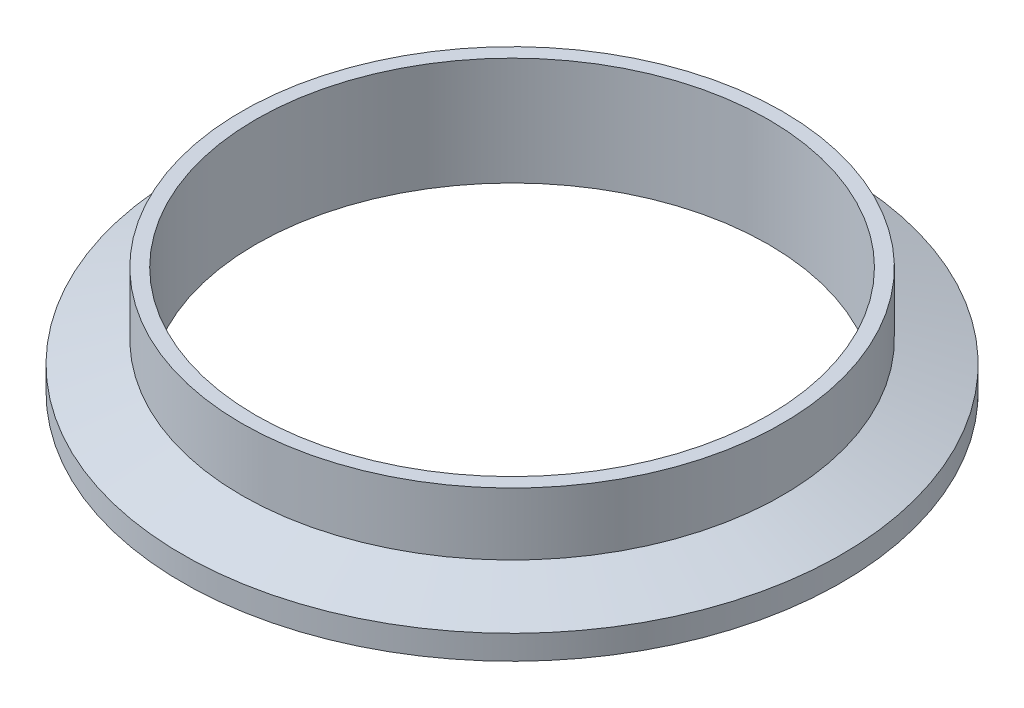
ISO-10303-21;
HEADER;
FILE_DESCRIPTION(('STEP AP214'),'2;1');
FILE_NAME('part.step','',(''),(''),'','','');
FILE_SCHEMA(('AUTOMOTIVE_DESIGN { 1 0 10303 214 1 1 1 1 }'));
ENDSEC;
DATA;
#1=APPLICATION_CONTEXT('core data for automotive mechanical design processes');
#2=APPLICATION_PROTOCOL_DEFINITION('international standard','automotive_design',2000,#1);
#3=PRODUCT_CONTEXT('',#1,'mechanical');
#4=PRODUCT('Part','Part','',(#3));
#5=PRODUCT_RELATED_PRODUCT_CATEGORY('part','',(#4));
#6=PRODUCT_DEFINITION_FORMATION('','',#4);
#7=PRODUCT_DEFINITION_CONTEXT('part definition',#1,'design');
#8=PRODUCT_DEFINITION('design','',#6,#7);
#9=PRODUCT_DEFINITION_SHAPE('','',#8);
#10=(LENGTH_UNIT() NAMED_UNIT(*) SI_UNIT(.MILLI.,.METRE.));
#11=(NAMED_UNIT(*) PLANE_ANGLE_UNIT() SI_UNIT($,.RADIAN.));
#12=(NAMED_UNIT(*) SI_UNIT($,.STERADIAN.) SOLID_ANGLE_UNIT());
#13=UNCERTAINTY_MEASURE_WITH_UNIT(LENGTH_MEASURE(1.E-05),#10,'distance_accuracy_value','');
#14=(GEOMETRIC_REPRESENTATION_CONTEXT(3) GLOBAL_UNCERTAINTY_ASSIGNED_CONTEXT((#13)) GLOBAL_UNIT_ASSIGNED_CONTEXT((#10,
#11,#12)) REPRESENTATION_CONTEXT('',''));
#15=CARTESIAN_POINT('',(0.,0.,0.));
#16=DIRECTION('',(0.,0.,1.));
#17=DIRECTION('',(1.,0.,0.));
#18=AXIS2_PLACEMENT_3D('',#15,#16,#17);
#19=CARTESIAN_POINT('',(-1.66533453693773E-13,0.787400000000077,0.));
#20=DIRECTION('',(0.,-1.00000000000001,0.));
#21=DIRECTION('',(0.,0.,-1.));
#22=AXIS2_PLACEMENT_3D('',#19,#20,#21);
#23=TOROIDAL_SURFACE('',#22,37.1367084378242,0.787400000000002);
#24=CARTESIAN_POINT('',(0.,0.,0.));
#25=DIRECTION('',(0.,-1.00000000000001,0.));
#26=DIRECTION('',(0.,0.,-1.));
#27=AXIS2_PLACEMENT_3D('',#24,#25,#26);
#28=CIRCLE('',#27,37.1367084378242);
#29=CARTESIAN_POINT('',(0.,0.,-37.1367084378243));
#30=VERTEX_POINT('',#29);
#31=EDGE_CURVE('E74',#30,#30,#28,.T.);
#32=ORIENTED_EDGE('',*,*,#31,.T.);
#33=EDGE_LOOP('',(#32));
#34=FACE_BOUND('',#33,.T.);
#35=CARTESIAN_POINT('',(-2.4980018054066E-13,0.474458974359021,0.));
#36=DIRECTION('',(0.,-1.00000000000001,0.));
#37=DIRECTION('',(0.,0.,-1.));
#38=AXIS2_PLACEMENT_3D('',#35,#36,#37);
#39=CIRCLE('',#38,36.4141666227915);
#40=CARTESIAN_POINT('',(-3.04377772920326E-13,0.47445897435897,-36.4141666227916));
#41=VERTEX_POINT('',#40);
#42=EDGE_CURVE('E12',#41,#41,#39,.T.);
#43=ORIENTED_EDGE('',*,*,#42,.F.);
#44=EDGE_LOOP('',(#43));
#45=FACE_BOUND('',#44,.T.);
#46=ADVANCED_FACE('F40',(#34,#45),#23,.T.);
#47=CARTESIAN_POINT('',(0.,0.,0.));
#48=DIRECTION('',(0.,-1.00000000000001,0.));
#49=DIRECTION('',(0.,0.,-1.));
#50=AXIS2_PLACEMENT_3D('',#47,#48,#49);
#51=TOROIDAL_SURFACE('',#50,35.3187,1.1938);
#52=CARTESIAN_POINT('',(-2.4980018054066E-13,0.474458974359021,0.));
#53=DIRECTION('',(0.,-1.00000000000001,0.));
#54=DIRECTION('',(0.,0.,-1.));
#55=AXIS2_PLACEMENT_3D('',#52,#53,#54);
#56=CIRCLE('',#55,34.2232333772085);
#57=CARTESIAN_POINT('',(-3.01093999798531E-13,0.474458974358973,-34.2232333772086));
#58=VERTEX_POINT('',#57);
#59=EDGE_CURVE('E46',#58,#58,#56,.T.);
#60=ORIENTED_EDGE('',*,*,#59,.F.);
#61=EDGE_LOOP('',(#60));
#62=FACE_BOUND('',#61,.T.);
#63=ORIENTED_EDGE('',*,*,#42,.T.);
#64=EDGE_LOOP('',(#63));
#65=FACE_BOUND('',#64,.T.);
#66=ADVANCED_FACE('F122',(#62,#65),#51,.F.);
#67=CARTESIAN_POINT('',(-1.66533453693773E-13,0.787400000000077,0.));
#68=DIRECTION('',(0.,-1.00000000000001,0.));
#69=DIRECTION('',(0.,0.,-1.));
#70=AXIS2_PLACEMENT_3D('',#67,#68,#69);
#71=TOROIDAL_SURFACE('',#70,33.5006915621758,0.787399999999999);
#72=ORIENTED_EDGE('',*,*,#59,.T.);
#73=EDGE_LOOP('',(#72));
#74=FACE_BOUND('',#73,.T.);
#75=CARTESIAN_POINT('',(0.,0.,0.));
#76=DIRECTION('',(0.,-1.00000000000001,0.));
#77=DIRECTION('',(0.,0.,-1.));
#78=AXIS2_PLACEMENT_3D('',#75,#76,#77);
#79=CIRCLE('',#78,33.5006915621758);
#80=CARTESIAN_POINT('',(0.,0.,-33.5006915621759));
#81=VERTEX_POINT('',#80);
#82=EDGE_CURVE('E50',#81,#81,#79,.T.);
#83=ORIENTED_EDGE('',*,*,#82,.F.);
#84=EDGE_LOOP('',(#83));
#85=FACE_BOUND('',#84,.T.);
#86=ADVANCED_FACE('F118',(#74,#85),#71,.T.);
#87=CARTESIAN_POINT('',(0.,0.,0.));
#88=DIRECTION('',(0.,1.00000000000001,0.));
#89=DIRECTION('',(0.,0.,1.));
#90=AXIS2_PLACEMENT_3D('',#87,#88,#89);
#91=PLANE('',#90);
#92=CARTESIAN_POINT('',(0.,0.,0.));
#93=DIRECTION('',(0.,-1.00000000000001,0.));
#94=DIRECTION('',(0.,0.,-1.));
#95=AXIS2_PLACEMENT_3D('',#92,#93,#94);
#96=CIRCLE('',#95,30.099);
#97=CARTESIAN_POINT('',(0.,0.,-30.0990000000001));
#98=VERTEX_POINT('',#97);
#99=EDGE_CURVE('E54',#98,#98,#96,.T.);
#100=ORIENTED_EDGE('',*,*,#99,.F.);
#101=EDGE_LOOP('',(#100));
#102=FACE_BOUND('',#101,.T.);
#103=ORIENTED_EDGE('',*,*,#82,.T.);
#104=EDGE_LOOP('',(#103));
#105=FACE_BOUND('',#104,.T.);
#106=ADVANCED_FACE('F112',(#102,#105),#91,.F.);
#107=CARTESIAN_POINT('',(0.,0.,0.));
#108=DIRECTION('',(0.,-1.00000000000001,0.));
#109=DIRECTION('',(0.,0.,-1.));
#110=AXIS2_PLACEMENT_3D('',#107,#108,#109);
#111=CYLINDRICAL_SURFACE('',#110,30.099);
#112=ORIENTED_EDGE('',*,*,#99,.T.);
#113=EDGE_LOOP('',(#112));
#114=FACE_BOUND('',#113,.T.);
#115=CARTESIAN_POINT('',(0.,12.7000000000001,0.));
#116=DIRECTION('',(0.,-1.00000000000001,0.));
#117=DIRECTION('',(0.,0.,-1.));
#118=AXIS2_PLACEMENT_3D('',#115,#116,#117);
#119=CIRCLE('',#118,30.099);
#120=CARTESIAN_POINT('',(-1.28379140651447E-13,12.7000000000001,-30.0990000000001));
#121=VERTEX_POINT('',#120);
#122=EDGE_CURVE('E59',#121,#121,#119,.T.);
#123=ORIENTED_EDGE('',*,*,#122,.F.);
#124=EDGE_LOOP('',(#123));
#125=FACE_BOUND('',#124,.T.);
#126=ADVANCED_FACE('F107',(#114,#125),#111,.F.);
#127=CARTESIAN_POINT('',(0.,12.7000000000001,0.));
#128=DIRECTION('',(0.,-1.00000000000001,0.));
#129=DIRECTION('',(0.,0.,-1.));
#130=AXIS2_PLACEMENT_3D('',#127,#128,#129);
#131=PLANE('',#130);
#132=CARTESIAN_POINT('',(0.,12.7000000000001,0.));
#133=DIRECTION('',(0.,-1.00000000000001,0.));
#134=DIRECTION('',(0.,0.,-1.));
#135=AXIS2_PLACEMENT_3D('',#132,#133,#134);
#136=CIRCLE('',#135,31.75);
#137=CARTESIAN_POINT('',(-1.30853661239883E-13,12.7000000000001,-31.7500000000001));
#138=VERTEX_POINT('',#137);
#139=EDGE_CURVE('E62',#138,#138,#136,.T.);
#140=ORIENTED_EDGE('',*,*,#139,.F.);
#141=EDGE_LOOP('',(#140));
#142=FACE_BOUND('',#141,.T.);
#143=ORIENTED_EDGE('',*,*,#122,.T.);
#144=EDGE_LOOP('',(#143));
#145=FACE_BOUND('',#144,.T.);
#146=ADVANCED_FACE('F101',(#142,#145),#131,.F.);
#147=CARTESIAN_POINT('',(0.,0.,0.));
#148=DIRECTION('',(0.,-1.00000000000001,0.));
#149=DIRECTION('',(0.,0.,-1.));
#150=AXIS2_PLACEMENT_3D('',#147,#148,#149);
#151=CYLINDRICAL_SURFACE('',#150,31.75);
#152=CARTESIAN_POINT('',(0.,5.37788724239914,-1.94289029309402E-13));
#153=DIRECTION('',(0.,-1.00000000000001,0.));
#154=DIRECTION('',(0.,0.,-1.));
#155=AXIS2_PLACEMENT_3D('',#152,#153,#154);
#156=CIRCLE('',#155,31.75);
#157=CARTESIAN_POINT('',(-1.30853661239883E-13,5.3778872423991,-31.7500000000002));
#158=VERTEX_POINT('',#157);
#159=EDGE_CURVE('E65',#158,#158,#156,.T.);
#160=ORIENTED_EDGE('',*,*,#159,.F.);
#161=EDGE_LOOP('',(#160));
#162=FACE_BOUND('',#161,.T.);
#163=ORIENTED_EDGE('',*,*,#139,.T.);
#164=EDGE_LOOP('',(#163));
#165=FACE_BOUND('',#164,.T.);
#166=ADVANCED_FACE('F95',(#162,#165),#151,.T.);
#167=CARTESIAN_POINT('',(0.,5.37788724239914,-1.94289029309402E-13));
#168=DIRECTION('',(0.,-1.00000000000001,0.));
#169=DIRECTION('',(0.,0.,-1.));
#170=AXIS2_PLACEMENT_3D('',#167,#168,#169);
#171=CONICAL_SURFACE('',#170,31.75,1.22173047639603);
#172=CARTESIAN_POINT('',(0.,2.84480000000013,0.));
#173=DIRECTION('',(0.,-1.00000000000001,0.));
#174=DIRECTION('',(0.,0.,-1.));
#175=AXIS2_PLACEMENT_3D('',#172,#173,#174);
#176=CIRCLE('',#175,38.7096);
#177=CARTESIAN_POINT('',(-1.41284717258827E-13,2.84480000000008,-38.7096));
#178=VERTEX_POINT('',#177);
#179=EDGE_CURVE('E68',#178,#178,#176,.T.);
#180=ORIENTED_EDGE('',*,*,#179,.F.);
#181=EDGE_LOOP('',(#180));
#182=FACE_BOUND('',#181,.T.);
#183=ORIENTED_EDGE('',*,*,#159,.T.);
#184=EDGE_LOOP('',(#183));
#185=FACE_BOUND('',#184,.T.);
#186=ADVANCED_FACE('F89',(#182,#185),#171,.T.);
#187=CARTESIAN_POINT('',(0.,0.,0.));
#188=DIRECTION('',(0.,-1.00000000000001,0.));
#189=DIRECTION('',(0.,0.,-1.));
#190=AXIS2_PLACEMENT_3D('',#187,#188,#189);
#191=CYLINDRICAL_SURFACE('',#190,38.7096);
#192=CARTESIAN_POINT('',(0.,0.,0.));
#193=DIRECTION('',(0.,-1.00000000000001,0.));
#194=DIRECTION('',(0.,0.,-1.));
#195=AXIS2_PLACEMENT_3D('',#192,#193,#194);
#196=CIRCLE('',#195,38.7096);
#197=CARTESIAN_POINT('',(0.,0.,-38.7096000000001));
#198=VERTEX_POINT('',#197);
#199=EDGE_CURVE('E71',#198,#198,#196,.T.);
#200=ORIENTED_EDGE('',*,*,#199,.F.);
#201=EDGE_LOOP('',(#200));
#202=FACE_BOUND('',#201,.T.);
#203=ORIENTED_EDGE('',*,*,#179,.T.);
#204=EDGE_LOOP('',(#203));
#205=FACE_BOUND('',#204,.T.);
#206=ADVANCED_FACE('F83',(#202,#205),#191,.T.);
#207=CARTESIAN_POINT('',(0.,0.,0.));
#208=DIRECTION('',(0.,1.00000000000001,0.));
#209=DIRECTION('',(0.,0.,1.));
#210=AXIS2_PLACEMENT_3D('',#207,#208,#209);
#211=PLANE('',#210);
#212=ORIENTED_EDGE('',*,*,#31,.F.);
#213=EDGE_LOOP('',(#212));
#214=FACE_BOUND('',#213,.T.);
#215=ORIENTED_EDGE('',*,*,#199,.T.);
#216=EDGE_LOOP('',(#215));
#217=FACE_BOUND('',#216,.T.);
#218=ADVANCED_FACE('F80',(#214,#217),#211,.F.);
#219=CLOSED_SHELL('',(#46,#66,#86,#106,#126,#146,#166,#186,#206,#218));
#220=MANIFOLD_SOLID_BREP('B2',#219);
#221=ADVANCED_BREP_SHAPE_REPRESENTATION('',(#18,#220),#14);
#222=SHAPE_DEFINITION_REPRESENTATION(#9,#221);
ENDSEC;
END-ISO-10303-21;
